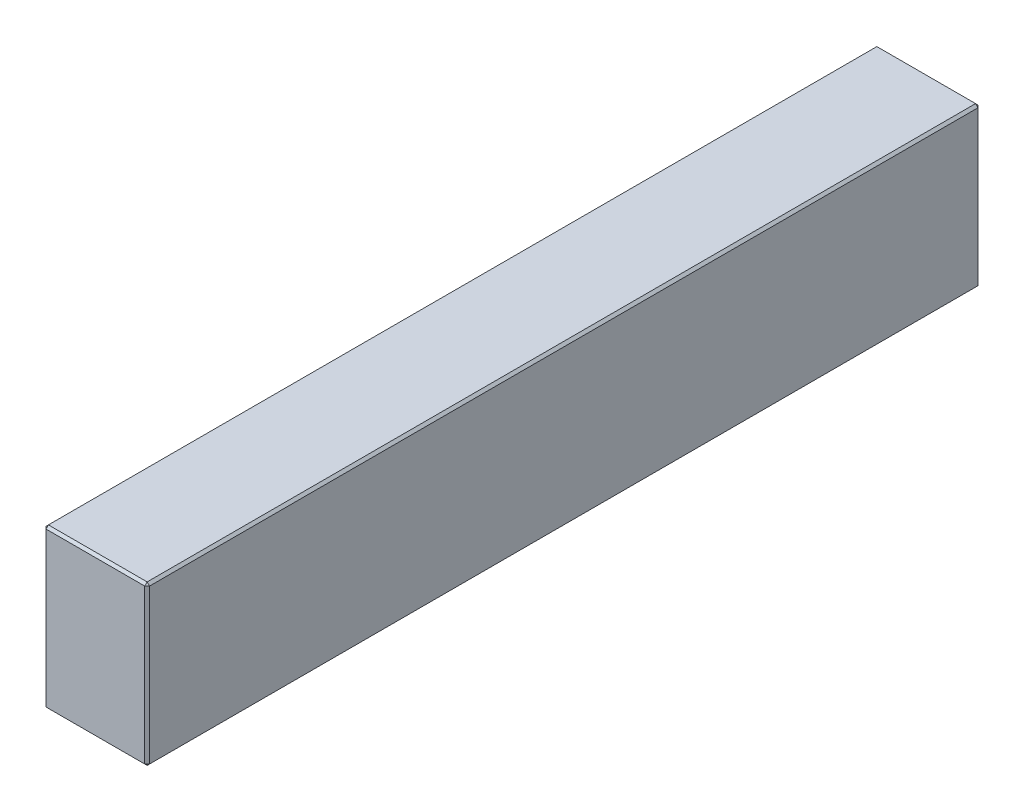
ISO-10303-21;
HEADER;
FILE_DESCRIPTION(('STEP AP214'),'2;1');
FILE_NAME('part.step','',(''),(''),'','','');
FILE_SCHEMA(('AUTOMOTIVE_DESIGN { 1 0 10303 214 1 1 1 1 }'));
ENDSEC;
DATA;
#1=APPLICATION_CONTEXT('core data for automotive mechanical design processes');
#2=APPLICATION_PROTOCOL_DEFINITION('international standard','automotive_design',2000,#1);
#3=PRODUCT_CONTEXT('',#1,'mechanical');
#4=PRODUCT('Part','Part','',(#3));
#5=PRODUCT_RELATED_PRODUCT_CATEGORY('part','',(#4));
#6=PRODUCT_DEFINITION_FORMATION('','',#4);
#7=PRODUCT_DEFINITION_CONTEXT('part definition',#1,'design');
#8=PRODUCT_DEFINITION('design','',#6,#7);
#9=PRODUCT_DEFINITION_SHAPE('','',#8);
#10=(LENGTH_UNIT() NAMED_UNIT(*) SI_UNIT(.MILLI.,.METRE.));
#11=(NAMED_UNIT(*) PLANE_ANGLE_UNIT() SI_UNIT($,.RADIAN.));
#12=(NAMED_UNIT(*) SI_UNIT($,.STERADIAN.) SOLID_ANGLE_UNIT());
#13=UNCERTAINTY_MEASURE_WITH_UNIT(LENGTH_MEASURE(1.E-05),#10,'distance_accuracy_value','');
#14=(GEOMETRIC_REPRESENTATION_CONTEXT(3) GLOBAL_UNCERTAINTY_ASSIGNED_CONTEXT((#13)) GLOBAL_UNIT_ASSIGNED_CONTEXT((#10,
#11,#12)) REPRESENTATION_CONTEXT('',''));
#15=CARTESIAN_POINT('',(0.,0.,0.));
#16=DIRECTION('',(0.,0.,1.));
#17=DIRECTION('',(1.,0.,0.));
#18=AXIS2_PLACEMENT_3D('',#15,#16,#17);
#19=CARTESIAN_POINT('',(-21.5,66.,173.));
#20=DIRECTION('',(1.,0.,0.));
#21=DIRECTION('',(0.,0.,-1.));
#22=AXIS2_PLACEMENT_3D('',#19,#20,#21);
#23=PLANE('',#22);
#24=DIRECTION('',(0.,-1.,0.));
#25=VECTOR('',#24,1.);
#26=CARTESIAN_POINT('',(-21.5,66.,-172.));
#27=LINE('',#26,#25);
#28=CARTESIAN_POINT('',(-21.5,65.,-172.));
#29=VERTEX_POINT('',#28);
#30=CARTESIAN_POINT('',(-21.5,1.,-172.));
#31=VERTEX_POINT('',#30);
#32=EDGE_CURVE('E114',#29,#31,#27,.T.);
#33=ORIENTED_EDGE('',*,*,#32,.T.);
#34=DIRECTION('',(0.,0.,1.));
#35=VECTOR('',#34,1.);
#36=CARTESIAN_POINT('',(-21.5,1.,173.));
#37=LINE('',#36,#35);
#38=CARTESIAN_POINT('',(-21.5,1.,172.));
#39=VERTEX_POINT('',#38);
#40=EDGE_CURVE('E110',#31,#39,#37,.T.);
#41=ORIENTED_EDGE('',*,*,#40,.T.);
#42=DIRECTION('',(0.,1.,0.));
#43=VECTOR('',#42,1.);
#44=CARTESIAN_POINT('',(-21.5,66.,172.));
#45=LINE('',#44,#43);
#46=CARTESIAN_POINT('',(-21.5,65.,172.));
#47=VERTEX_POINT('',#46);
#48=EDGE_CURVE('E103',#39,#47,#45,.T.);
#49=ORIENTED_EDGE('',*,*,#48,.T.);
#50=DIRECTION('',(0.,0.,-1.));
#51=VECTOR('',#50,1.);
#52=CARTESIAN_POINT('',(-21.5,65.,-173.));
#53=LINE('',#52,#51);
#54=EDGE_CURVE('E107',#47,#29,#53,.T.);
#55=ORIENTED_EDGE('',*,*,#54,.T.);
#56=EDGE_LOOP('',(#33,#41,#49,#55));
#57=FACE_BOUND('',#56,.T.);
#58=ADVANCED_FACE('F15',(#57),#23,.F.);
#59=CARTESIAN_POINT('',(21.5,66.,173.));
#60=DIRECTION('',(0.,0.,-1.));
#61=DIRECTION('',(-1.,0.,0.));
#62=AXIS2_PLACEMENT_3D('',#59,#60,#61);
#63=PLANE('',#62);
#64=DIRECTION('',(-1.,0.,0.));
#65=VECTOR('',#64,1.);
#66=CARTESIAN_POINT('',(-21.5,65.,173.));
#67=LINE('',#66,#65);
#68=CARTESIAN_POINT('',(20.5,65.,173.));
#69=VERTEX_POINT('',#68);
#70=CARTESIAN_POINT('',(-20.5,65.,173.));
#71=VERTEX_POINT('',#70);
#72=EDGE_CURVE('E164',#69,#71,#67,.T.);
#73=ORIENTED_EDGE('',*,*,#72,.T.);
#74=DIRECTION('',(0.,-1.,0.));
#75=VECTOR('',#74,1.);
#76=CARTESIAN_POINT('',(-20.5,66.,173.));
#77=LINE('',#76,#75);
#78=CARTESIAN_POINT('',(-20.5,1.,173.));
#79=VERTEX_POINT('',#78);
#80=EDGE_CURVE('E122',#71,#79,#77,.T.);
#81=ORIENTED_EDGE('',*,*,#80,.T.);
#82=DIRECTION('',(1.,0.,0.));
#83=VECTOR('',#82,1.);
#84=CARTESIAN_POINT('',(21.5,1.,173.));
#85=LINE('',#84,#83);
#86=CARTESIAN_POINT('',(20.5,1.,173.));
#87=VERTEX_POINT('',#86);
#88=EDGE_CURVE('E168',#79,#87,#85,.T.);
#89=ORIENTED_EDGE('',*,*,#88,.T.);
#90=DIRECTION('',(0.,1.,0.));
#91=VECTOR('',#90,1.);
#92=CARTESIAN_POINT('',(20.5,66.,173.));
#93=LINE('',#92,#91);
#94=EDGE_CURVE('E166',#87,#69,#93,.T.);
#95=ORIENTED_EDGE('',*,*,#94,.T.);
#96=EDGE_LOOP('',(#73,#81,#89,#95));
#97=FACE_BOUND('',#96,.T.);
#98=ADVANCED_FACE('F275',(#97),#63,.F.);
#99=CARTESIAN_POINT('',(21.5,66.,173.));
#100=DIRECTION('',(-1.,0.,0.));
#101=DIRECTION('',(0.,0.,1.));
#102=AXIS2_PLACEMENT_3D('',#99,#100,#101);
#103=PLANE('',#102);
#104=DIRECTION('',(0.,0.,-1.));
#105=VECTOR('',#104,1.);
#106=CARTESIAN_POINT('',(21.5,1.,173.));
#107=LINE('',#106,#105);
#108=CARTESIAN_POINT('',(21.5,1.,172.));
#109=VERTEX_POINT('',#108);
#110=CARTESIAN_POINT('',(21.5,1.,-172.));
#111=VERTEX_POINT('',#110);
#112=EDGE_CURVE('E159',#109,#111,#107,.T.);
#113=ORIENTED_EDGE('',*,*,#112,.T.);
#114=DIRECTION('',(0.,1.,0.));
#115=VECTOR('',#114,1.);
#116=CARTESIAN_POINT('',(21.5,66.,-172.));
#117=LINE('',#116,#115);
#118=CARTESIAN_POINT('',(21.5,65.,-172.));
#119=VERTEX_POINT('',#118);
#120=EDGE_CURVE('E161',#111,#119,#117,.T.);
#121=ORIENTED_EDGE('',*,*,#120,.T.);
#122=DIRECTION('',(0.,0.,1.));
#123=VECTOR('',#122,1.);
#124=CARTESIAN_POINT('',(21.5,65.,173.));
#125=LINE('',#124,#123);
#126=CARTESIAN_POINT('',(21.5,65.,172.));
#127=VERTEX_POINT('',#126);
#128=EDGE_CURVE('E155',#119,#127,#125,.T.);
#129=ORIENTED_EDGE('',*,*,#128,.T.);
#130=DIRECTION('',(0.,-1.,0.));
#131=VECTOR('',#130,1.);
#132=CARTESIAN_POINT('',(21.5,66.,172.));
#133=LINE('',#132,#131);
#134=EDGE_CURVE('E157',#127,#109,#133,.T.);
#135=ORIENTED_EDGE('',*,*,#134,.T.);
#136=EDGE_LOOP('',(#113,#121,#129,#135));
#137=FACE_BOUND('',#136,.T.);
#138=ADVANCED_FACE('F254',(#137),#103,.F.);
#139=CARTESIAN_POINT('',(21.5,66.,-173.));
#140=DIRECTION('',(0.,0.,1.));
#141=DIRECTION('',(1.,0.,0.));
#142=AXIS2_PLACEMENT_3D('',#139,#140,#141);
#143=PLANE('',#142);
#144=DIRECTION('',(0.,-1.,0.));
#145=VECTOR('',#144,1.);
#146=CARTESIAN_POINT('',(20.5,66.,-173.));
#147=LINE('',#146,#145);
#148=CARTESIAN_POINT('',(20.5,65.,-173.));
#149=VERTEX_POINT('',#148);
#150=CARTESIAN_POINT('',(20.5,1.,-173.));
#151=VERTEX_POINT('',#150);
#152=EDGE_CURVE('E148',#149,#151,#147,.T.);
#153=ORIENTED_EDGE('',*,*,#152,.T.);
#154=DIRECTION('',(-1.,0.,0.));
#155=VECTOR('',#154,1.);
#156=CARTESIAN_POINT('',(21.5,1.,-173.));
#157=LINE('',#156,#155);
#158=CARTESIAN_POINT('',(-20.5,1.,-173.));
#159=VERTEX_POINT('',#158);
#160=EDGE_CURVE('E153',#151,#159,#157,.T.);
#161=ORIENTED_EDGE('',*,*,#160,.T.);
#162=DIRECTION('',(0.,1.,0.));
#163=VECTOR('',#162,1.);
#164=CARTESIAN_POINT('',(-20.5,66.,-173.));
#165=LINE('',#164,#163);
#166=CARTESIAN_POINT('',(-20.5,65.,-173.));
#167=VERTEX_POINT('',#166);
#168=EDGE_CURVE('E150',#159,#167,#165,.T.);
#169=ORIENTED_EDGE('',*,*,#168,.T.);
#170=DIRECTION('',(1.,0.,0.));
#171=VECTOR('',#170,1.);
#172=CARTESIAN_POINT('',(21.5,65.,-173.));
#173=LINE('',#172,#171);
#174=EDGE_CURVE('E146',#167,#149,#173,.T.);
#175=ORIENTED_EDGE('',*,*,#174,.T.);
#176=EDGE_LOOP('',(#153,#161,#169,#175));
#177=FACE_BOUND('',#176,.T.);
#178=ADVANCED_FACE('F284',(#177),#143,.F.);
#179=CARTESIAN_POINT('',(0.,66.,0.));
#180=DIRECTION('',(0.,1.,0.));
#181=DIRECTION('',(0.,0.,1.));
#182=AXIS2_PLACEMENT_3D('',#179,#180,#181);
#183=PLANE('',#182);
#184=DIRECTION('',(0.,0.,-1.));
#185=VECTOR('',#184,1.);
#186=CARTESIAN_POINT('',(20.5,66.,-173.));
#187=LINE('',#186,#185);
#188=CARTESIAN_POINT('',(20.5,66.,172.));
#189=VERTEX_POINT('',#188);
#190=CARTESIAN_POINT('',(20.5,66.,-172.));
#191=VERTEX_POINT('',#190);
#192=EDGE_CURVE('E24',#189,#191,#187,.T.);
#193=ORIENTED_EDGE('',*,*,#192,.T.);
#194=DIRECTION('',(-1.,0.,0.));
#195=VECTOR('',#194,1.);
#196=CARTESIAN_POINT('',(-21.5,66.,-172.));
#197=LINE('',#196,#195);
#198=CARTESIAN_POINT('',(-20.5,66.,-172.));
#199=VERTEX_POINT('',#198);
#200=EDGE_CURVE('E9',#191,#199,#197,.T.);
#201=ORIENTED_EDGE('',*,*,#200,.T.);
#202=DIRECTION('',(0.,0.,1.));
#203=VECTOR('',#202,1.);
#204=CARTESIAN_POINT('',(-20.5,66.,173.));
#205=LINE('',#204,#203);
#206=CARTESIAN_POINT('',(-20.5,66.,172.));
#207=VERTEX_POINT('',#206);
#208=EDGE_CURVE('E180',#199,#207,#205,.T.);
#209=ORIENTED_EDGE('',*,*,#208,.T.);
#210=DIRECTION('',(1.,0.,0.));
#211=VECTOR('',#210,1.);
#212=CARTESIAN_POINT('',(21.5,66.,172.));
#213=LINE('',#212,#211);
#214=EDGE_CURVE('E35',#207,#189,#213,.T.);
#215=ORIENTED_EDGE('',*,*,#214,.T.);
#216=EDGE_LOOP('',(#193,#201,#209,#215));
#217=FACE_BOUND('',#216,.T.);
#218=ADVANCED_FACE('F350',(#217),#183,.T.);
#219=CARTESIAN_POINT('',(0.,0.,0.));
#220=DIRECTION('',(0.,1.,0.));
#221=DIRECTION('',(0.,0.,1.));
#222=AXIS2_PLACEMENT_3D('',#219,#220,#221);
#223=PLANE('',#222);
#224=DIRECTION('',(0.,0.,1.));
#225=VECTOR('',#224,1.);
#226=CARTESIAN_POINT('',(20.5,0.,0.));
#227=LINE('',#226,#225);
#228=CARTESIAN_POINT('',(20.5,0.,-172.));
#229=VERTEX_POINT('',#228);
#230=CARTESIAN_POINT('',(20.5,0.,172.));
#231=VERTEX_POINT('',#230);
#232=EDGE_CURVE('E171',#229,#231,#227,.T.);
#233=ORIENTED_EDGE('',*,*,#232,.T.);
#234=DIRECTION('',(-1.,0.,0.));
#235=VECTOR('',#234,1.);
#236=CARTESIAN_POINT('',(0.,0.,172.));
#237=LINE('',#236,#235);
#238=CARTESIAN_POINT('',(-20.5,0.,172.));
#239=VERTEX_POINT('',#238);
#240=EDGE_CURVE('E177',#231,#239,#237,.T.);
#241=ORIENTED_EDGE('',*,*,#240,.T.);
#242=DIRECTION('',(0.,0.,-1.));
#243=VECTOR('',#242,1.);
#244=CARTESIAN_POINT('',(-20.5,0.,0.));
#245=LINE('',#244,#243);
#246=CARTESIAN_POINT('',(-20.5,0.,-172.));
#247=VERTEX_POINT('',#246);
#248=EDGE_CURVE('E175',#239,#247,#245,.T.);
#249=ORIENTED_EDGE('',*,*,#248,.T.);
#250=DIRECTION('',(1.,0.,0.));
#251=VECTOR('',#250,1.);
#252=CARTESIAN_POINT('',(0.,0.,-172.));
#253=LINE('',#252,#251);
#254=EDGE_CURVE('E173',#247,#229,#253,.T.);
#255=ORIENTED_EDGE('',*,*,#254,.T.);
#256=EDGE_LOOP('',(#233,#241,#249,#255));
#257=FACE_BOUND('',#256,.T.);
#258=ADVANCED_FACE('F246',(#257),#223,.F.);
#259=CARTESIAN_POINT('',(21.5,66.,172.));
#260=DIRECTION('',(-0.707106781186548,0.,-0.707106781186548));
#261=DIRECTION('',(0.,-1.,0.));
#262=AXIS2_PLACEMENT_3D('',#259,#260,#261);
#263=PLANE('',#262);
#264=DIRECTION('',(-0.707106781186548,0.,0.707106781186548));
#265=VECTOR('',#264,1.);
#266=CARTESIAN_POINT('',(20.5,65.,173.));
#267=LINE('',#266,#265);
#268=EDGE_CURVE('E19',#69,#127,#267,.F.);
#269=ORIENTED_EDGE('',*,*,#268,.F.);
#270=ORIENTED_EDGE('',*,*,#94,.F.);
#271=DIRECTION('',(0.707106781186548,0.,-0.707106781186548));
#272=VECTOR('',#271,1.);
#273=CARTESIAN_POINT('',(20.5,1.,173.));
#274=LINE('',#273,#272);
#275=EDGE_CURVE('E142',#109,#87,#274,.F.);
#276=ORIENTED_EDGE('',*,*,#275,.F.);
#277=ORIENTED_EDGE('',*,*,#134,.F.);
#278=EDGE_LOOP('',(#269,#270,#276,#277));
#279=FACE_BOUND('',#278,.T.);
#280=ADVANCED_FACE('F17',(#279),#263,.F.);
#281=CARTESIAN_POINT('',(20.5,65.,173.));
#282=DIRECTION('',(0.577350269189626,0.577350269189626,0.577350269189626));
#283=DIRECTION('',(0.707106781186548,0.,-0.707106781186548));
#284=AXIS2_PLACEMENT_3D('',#281,#282,#283);
#285=PLANE('',#284);
#286=DIRECTION('',(0.,-0.707106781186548,0.707106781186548));
#287=VECTOR('',#286,1.);
#288=CARTESIAN_POINT('',(20.5,65.,173.));
#289=LINE('',#288,#287);
#290=EDGE_CURVE('E226',#69,#189,#289,.F.);
#291=ORIENTED_EDGE('',*,*,#290,.F.);
#292=ORIENTED_EDGE('',*,*,#268,.T.);
#293=DIRECTION('',(-0.707106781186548,0.707106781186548,0.));
#294=VECTOR('',#293,1.);
#295=CARTESIAN_POINT('',(21.,65.5,172.));
#296=LINE('',#295,#294);
#297=EDGE_CURVE('E228',#189,#127,#296,.F.);
#298=ORIENTED_EDGE('',*,*,#297,.F.);
#299=EDGE_LOOP('',(#291,#292,#298));
#300=FACE_BOUND('',#299,.T.);
#301=ADVANCED_FACE('F270',(#300),#285,.T.);
#302=CARTESIAN_POINT('',(20.5,1.,173.));
#303=DIRECTION('',(0.577350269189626,-0.577350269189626,0.577350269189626));
#304=DIRECTION('',(0.707106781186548,0.,-0.707106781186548));
#305=AXIS2_PLACEMENT_3D('',#302,#303,#304);
#306=PLANE('',#305);
#307=DIRECTION('',(-0.707106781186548,-0.707106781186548,0.));
#308=VECTOR('',#307,1.);
#309=CARTESIAN_POINT('',(21.,0.5,172.));
#310=LINE('',#309,#308);
#311=EDGE_CURVE('E220',#109,#231,#310,.T.);
#312=ORIENTED_EDGE('',*,*,#311,.F.);
#313=ORIENTED_EDGE('',*,*,#275,.T.);
#314=DIRECTION('',(0.,0.707106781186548,0.707106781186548));
#315=VECTOR('',#314,1.);
#316=CARTESIAN_POINT('',(20.5,1.,173.));
#317=LINE('',#316,#315);
#318=EDGE_CURVE('E223',#231,#87,#317,.T.);
#319=ORIENTED_EDGE('',*,*,#318,.F.);
#320=EDGE_LOOP('',(#312,#313,#319));
#321=FACE_BOUND('',#320,.T.);
#322=ADVANCED_FACE('F235',(#321),#306,.T.);
#323=CARTESIAN_POINT('',(20.5,66.,0.));
#324=DIRECTION('',(0.707106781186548,0.707106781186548,0.));
#325=DIRECTION('',(0.,0.,1.));
#326=AXIS2_PLACEMENT_3D('',#323,#324,#325);
#327=PLANE('',#326);
#328=ORIENTED_EDGE('',*,*,#297,.T.);
#329=ORIENTED_EDGE('',*,*,#128,.F.);
#330=DIRECTION('',(0.707106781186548,-0.707106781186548,0.));
#331=VECTOR('',#330,1.);
#332=CARTESIAN_POINT('',(21.5,65.,-172.));
#333=LINE('',#332,#331);
#334=EDGE_CURVE('E215',#191,#119,#333,.T.);
#335=ORIENTED_EDGE('',*,*,#334,.F.);
#336=ORIENTED_EDGE('',*,*,#192,.F.);
#337=EDGE_LOOP('',(#328,#329,#335,#336));
#338=FACE_BOUND('',#337,.T.);
#339=ADVANCED_FACE('F265',(#338),#327,.T.);
#340=CARTESIAN_POINT('',(0.,66.,172.));
#341=DIRECTION('',(0.,0.707106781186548,0.707106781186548));
#342=DIRECTION('',(-1.,0.,0.));
#343=AXIS2_PLACEMENT_3D('',#340,#341,#342);
#344=PLANE('',#343);
#345=ORIENTED_EDGE('',*,*,#290,.T.);
#346=ORIENTED_EDGE('',*,*,#214,.F.);
#347=DIRECTION('',(0.,0.707106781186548,-0.707106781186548));
#348=VECTOR('',#347,1.);
#349=CARTESIAN_POINT('',(-20.5,65.5,172.5));
#350=LINE('',#349,#348);
#351=EDGE_CURVE('E126',#71,#207,#350,.T.);
#352=ORIENTED_EDGE('',*,*,#351,.F.);
#353=ORIENTED_EDGE('',*,*,#72,.F.);
#354=EDGE_LOOP('',(#345,#346,#352,#353));
#355=FACE_BOUND('',#354,.T.);
#356=ADVANCED_FACE('F273',(#355),#344,.T.);
#357=CARTESIAN_POINT('',(-20.5,66.,173.));
#358=DIRECTION('',(0.707106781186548,0.,-0.707106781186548));
#359=DIRECTION('',(0.,-1.,0.));
#360=AXIS2_PLACEMENT_3D('',#357,#358,#359);
#361=PLANE('',#360);
#362=DIRECTION('',(0.707106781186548,0.,0.707106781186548));
#363=VECTOR('',#362,1.);
#364=CARTESIAN_POINT('',(-20.5,1.,173.));
#365=LINE('',#364,#363);
#366=EDGE_CURVE('E127',#79,#39,#365,.F.);
#367=ORIENTED_EDGE('',*,*,#366,.F.);
#368=ORIENTED_EDGE('',*,*,#80,.F.);
#369=DIRECTION('',(-0.707106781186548,0.,-0.707106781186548));
#370=VECTOR('',#369,1.);
#371=CARTESIAN_POINT('',(-21.5,65.,172.));
#372=LINE('',#371,#370);
#373=EDGE_CURVE('E118',#47,#71,#372,.F.);
#374=ORIENTED_EDGE('',*,*,#373,.F.);
#375=ORIENTED_EDGE('',*,*,#48,.F.);
#376=EDGE_LOOP('',(#367,#368,#374,#375));
#377=FACE_BOUND('',#376,.T.);
#378=ADVANCED_FACE('F120',(#377),#361,.F.);
#379=CARTESIAN_POINT('',(21.5,1.,173.));
#380=DIRECTION('',(0.,0.707106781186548,-0.707106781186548));
#381=DIRECTION('',(1.,0.,0.));
#382=AXIS2_PLACEMENT_3D('',#379,#380,#381);
#383=PLANE('',#382);
#384=ORIENTED_EDGE('',*,*,#318,.T.);
#385=ORIENTED_EDGE('',*,*,#88,.F.);
#386=DIRECTION('',(0.,-0.707106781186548,-0.707106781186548));
#387=VECTOR('',#386,1.);
#388=CARTESIAN_POINT('',(-20.5,1.,173.));
#389=LINE('',#388,#387);
#390=EDGE_CURVE('E211',#239,#79,#389,.F.);
#391=ORIENTED_EDGE('',*,*,#390,.F.);
#392=ORIENTED_EDGE('',*,*,#240,.F.);
#393=EDGE_LOOP('',(#384,#385,#391,#392));
#394=FACE_BOUND('',#393,.T.);
#395=ADVANCED_FACE('F243',(#394),#383,.F.);
#396=CARTESIAN_POINT('',(21.5,1.,173.));
#397=DIRECTION('',(-0.707106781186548,0.707106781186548,0.));
#398=DIRECTION('',(0.,0.,-1.));
#399=AXIS2_PLACEMENT_3D('',#396,#397,#398);
#400=PLANE('',#399);
#401=ORIENTED_EDGE('',*,*,#311,.T.);
#402=ORIENTED_EDGE('',*,*,#232,.F.);
#403=DIRECTION('',(0.707106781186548,0.707106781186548,0.));
#404=VECTOR('',#403,1.);
#405=CARTESIAN_POINT('',(21.,0.5,-172.));
#406=LINE('',#405,#404);
#407=EDGE_CURVE('E208',#111,#229,#406,.F.);
#408=ORIENTED_EDGE('',*,*,#407,.F.);
#409=ORIENTED_EDGE('',*,*,#112,.F.);
#410=EDGE_LOOP('',(#401,#402,#408,#409));
#411=FACE_BOUND('',#410,.T.);
#412=ADVANCED_FACE('F251',(#411),#400,.F.);
#413=CARTESIAN_POINT('',(20.5,66.,-173.));
#414=DIRECTION('',(-0.707106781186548,0.,0.707106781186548));
#415=DIRECTION('',(0.,-1.,0.));
#416=AXIS2_PLACEMENT_3D('',#413,#414,#415);
#417=PLANE('',#416);
#418=DIRECTION('',(0.707106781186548,0.,0.707106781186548));
#419=VECTOR('',#418,1.);
#420=CARTESIAN_POINT('',(21.5,65.,-172.));
#421=LINE('',#420,#419);
#422=EDGE_CURVE('E217',#119,#149,#421,.F.);
#423=ORIENTED_EDGE('',*,*,#422,.F.);
#424=ORIENTED_EDGE('',*,*,#120,.F.);
#425=DIRECTION('',(-0.707106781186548,0.,-0.707106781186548));
#426=VECTOR('',#425,1.);
#427=CARTESIAN_POINT('',(20.5,1.,-173.));
#428=LINE('',#427,#426);
#429=EDGE_CURVE('E205',#151,#111,#428,.F.);
#430=ORIENTED_EDGE('',*,*,#429,.F.);
#431=ORIENTED_EDGE('',*,*,#152,.F.);
#432=EDGE_LOOP('',(#423,#424,#430,#431));
#433=FACE_BOUND('',#432,.T.);
#434=ADVANCED_FACE('F258',(#433),#417,.F.);
#435=CARTESIAN_POINT('',(21.5,65.,-172.));
#436=DIRECTION('',(0.577350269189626,0.577350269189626,-0.577350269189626));
#437=DIRECTION('',(-0.707106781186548,0.,-0.707106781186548));
#438=AXIS2_PLACEMENT_3D('',#435,#436,#437);
#439=PLANE('',#438);
#440=ORIENTED_EDGE('',*,*,#334,.T.);
#441=ORIENTED_EDGE('',*,*,#422,.T.);
#442=DIRECTION('',(0.,0.707106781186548,0.707106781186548));
#443=VECTOR('',#442,1.);
#444=CARTESIAN_POINT('',(20.5,65.5,-172.5));
#445=LINE('',#444,#443);
#446=EDGE_CURVE('E134',#191,#149,#445,.F.);
#447=ORIENTED_EDGE('',*,*,#446,.F.);
#448=EDGE_LOOP('',(#440,#441,#447));
#449=FACE_BOUND('',#448,.T.);
#450=ADVANCED_FACE('F325',(#449),#439,.T.);
#451=CARTESIAN_POINT('',(-21.5,65.,172.));
#452=DIRECTION('',(-0.577350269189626,0.577350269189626,0.577350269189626));
#453=DIRECTION('',(0.707106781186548,0.,0.707106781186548));
#454=AXIS2_PLACEMENT_3D('',#451,#452,#453);
#455=PLANE('',#454);
#456=ORIENTED_EDGE('',*,*,#373,.T.);
#457=ORIENTED_EDGE('',*,*,#351,.T.);
#458=DIRECTION('',(-0.707106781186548,-0.707106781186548,0.));
#459=VECTOR('',#458,1.);
#460=CARTESIAN_POINT('',(-21.5,65.,172.));
#461=LINE('',#460,#459);
#462=EDGE_CURVE('E130',#47,#207,#461,.F.);
#463=ORIENTED_EDGE('',*,*,#462,.F.);
#464=EDGE_LOOP('',(#456,#457,#463));
#465=FACE_BOUND('',#464,.T.);
#466=ADVANCED_FACE('F131',(#465),#455,.T.);
#467=CARTESIAN_POINT('',(-20.5,1.,173.));
#468=DIRECTION('',(-0.577350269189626,-0.577350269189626,0.577350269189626));
#469=DIRECTION('',(0.707106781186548,0.,0.707106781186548));
#470=AXIS2_PLACEMENT_3D('',#467,#468,#469);
#471=PLANE('',#470);
#472=ORIENTED_EDGE('',*,*,#390,.T.);
#473=ORIENTED_EDGE('',*,*,#366,.T.);
#474=DIRECTION('',(-0.707106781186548,0.707106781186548,0.));
#475=VECTOR('',#474,1.);
#476=CARTESIAN_POINT('',(-21.,0.5,172.));
#477=LINE('',#476,#475);
#478=EDGE_CURVE('E135',#239,#39,#477,.T.);
#479=ORIENTED_EDGE('',*,*,#478,.F.);
#480=EDGE_LOOP('',(#472,#473,#479));
#481=FACE_BOUND('',#480,.T.);
#482=ADVANCED_FACE('F318',(#481),#471,.T.);
#483=CARTESIAN_POINT('',(20.5,1.,-173.));
#484=DIRECTION('',(0.577350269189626,-0.577350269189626,-0.577350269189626));
#485=DIRECTION('',(-0.707106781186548,0.,-0.707106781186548));
#486=AXIS2_PLACEMENT_3D('',#483,#484,#485);
#487=PLANE('',#486);
#488=ORIENTED_EDGE('',*,*,#429,.T.);
#489=ORIENTED_EDGE('',*,*,#407,.T.);
#490=DIRECTION('',(0.,-0.707106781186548,0.707106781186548));
#491=VECTOR('',#490,1.);
#492=CARTESIAN_POINT('',(20.5,1.,-173.));
#493=LINE('',#492,#491);
#494=EDGE_CURVE('E198',#151,#229,#493,.T.);
#495=ORIENTED_EDGE('',*,*,#494,.F.);
#496=EDGE_LOOP('',(#488,#489,#495));
#497=FACE_BOUND('',#496,.T.);
#498=ADVANCED_FACE('F314',(#497),#487,.T.);
#499=CARTESIAN_POINT('',(0.,66.,-172.));
#500=DIRECTION('',(0.,0.707106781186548,-0.707106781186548));
#501=DIRECTION('',(1.,0.,0.));
#502=AXIS2_PLACEMENT_3D('',#499,#500,#501);
#503=PLANE('',#502);
#504=ORIENTED_EDGE('',*,*,#446,.T.);
#505=ORIENTED_EDGE('',*,*,#174,.F.);
#506=DIRECTION('',(0.,-0.707106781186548,-0.707106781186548));
#507=VECTOR('',#506,1.);
#508=CARTESIAN_POINT('',(-20.5,65.,-173.));
#509=LINE('',#508,#507);
#510=EDGE_CURVE('E195',#199,#167,#509,.T.);
#511=ORIENTED_EDGE('',*,*,#510,.F.);
#512=ORIENTED_EDGE('',*,*,#200,.F.);
#513=EDGE_LOOP('',(#504,#505,#511,#512));
#514=FACE_BOUND('',#513,.T.);
#515=ADVANCED_FACE('F311',(#514),#503,.T.);
#516=CARTESIAN_POINT('',(-20.5,66.,0.));
#517=DIRECTION('',(-0.707106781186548,0.707106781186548,0.));
#518=DIRECTION('',(0.,0.,-1.));
#519=AXIS2_PLACEMENT_3D('',#516,#517,#518);
#520=PLANE('',#519);
#521=ORIENTED_EDGE('',*,*,#462,.T.);
#522=ORIENTED_EDGE('',*,*,#208,.F.);
#523=DIRECTION('',(0.707106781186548,0.707106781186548,0.));
#524=VECTOR('',#523,1.);
#525=CARTESIAN_POINT('',(-21.,65.5,-172.));
#526=LINE('',#525,#524);
#527=EDGE_CURVE('E138',#29,#199,#526,.T.);
#528=ORIENTED_EDGE('',*,*,#527,.F.);
#529=ORIENTED_EDGE('',*,*,#54,.F.);
#530=EDGE_LOOP('',(#521,#522,#528,#529));
#531=FACE_BOUND('',#530,.T.);
#532=ADVANCED_FACE('F137',(#531),#520,.T.);
#533=CARTESIAN_POINT('',(-21.5,1.,173.));
#534=DIRECTION('',(0.707106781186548,0.707106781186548,0.));
#535=DIRECTION('',(0.,0.,1.));
#536=AXIS2_PLACEMENT_3D('',#533,#534,#535);
#537=PLANE('',#536);
#538=ORIENTED_EDGE('',*,*,#478,.T.);
#539=ORIENTED_EDGE('',*,*,#40,.F.);
#540=DIRECTION('',(0.707106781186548,-0.707106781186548,0.));
#541=VECTOR('',#540,1.);
#542=CARTESIAN_POINT('',(-21.5,1.,-172.));
#543=LINE('',#542,#541);
#544=EDGE_CURVE('E191',#247,#31,#543,.F.);
#545=ORIENTED_EDGE('',*,*,#544,.F.);
#546=ORIENTED_EDGE('',*,*,#248,.F.);
#547=EDGE_LOOP('',(#538,#539,#545,#546));
#548=FACE_BOUND('',#547,.T.);
#549=ADVANCED_FACE('F304',(#548),#537,.F.);
#550=CARTESIAN_POINT('',(21.5,1.,-173.));
#551=DIRECTION('',(0.,0.707106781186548,0.707106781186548));
#552=DIRECTION('',(-1.,0.,0.));
#553=AXIS2_PLACEMENT_3D('',#550,#551,#552);
#554=PLANE('',#553);
#555=ORIENTED_EDGE('',*,*,#494,.T.);
#556=ORIENTED_EDGE('',*,*,#254,.F.);
#557=DIRECTION('',(0.,0.707106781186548,-0.707106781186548));
#558=VECTOR('',#557,1.);
#559=CARTESIAN_POINT('',(-20.5,0.5,-172.5));
#560=LINE('',#559,#558);
#561=EDGE_CURVE('E188',#159,#247,#560,.F.);
#562=ORIENTED_EDGE('',*,*,#561,.F.);
#563=ORIENTED_EDGE('',*,*,#160,.F.);
#564=EDGE_LOOP('',(#555,#556,#562,#563));
#565=FACE_BOUND('',#564,.T.);
#566=ADVANCED_FACE('F300',(#565),#554,.F.);
#567=CARTESIAN_POINT('',(-20.5,65.,-173.));
#568=DIRECTION('',(-0.577350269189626,0.577350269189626,-0.577350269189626));
#569=DIRECTION('',(-0.707106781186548,0.,0.707106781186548));
#570=AXIS2_PLACEMENT_3D('',#567,#568,#569);
#571=PLANE('',#570);
#572=ORIENTED_EDGE('',*,*,#527,.T.);
#573=ORIENTED_EDGE('',*,*,#510,.T.);
#574=DIRECTION('',(0.707106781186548,0.,-0.707106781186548));
#575=VECTOR('',#574,1.);
#576=CARTESIAN_POINT('',(-20.5,65.,-173.));
#577=LINE('',#576,#575);
#578=EDGE_CURVE('E186',#29,#167,#577,.T.);
#579=ORIENTED_EDGE('',*,*,#578,.F.);
#580=EDGE_LOOP('',(#572,#573,#579));
#581=FACE_BOUND('',#580,.T.);
#582=ADVANCED_FACE('F296',(#581),#571,.T.);
#583=CARTESIAN_POINT('',(-21.5,1.,-172.));
#584=DIRECTION('',(-0.577350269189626,-0.577350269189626,-0.577350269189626));
#585=DIRECTION('',(-0.707106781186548,0.,0.707106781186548));
#586=AXIS2_PLACEMENT_3D('',#583,#584,#585);
#587=PLANE('',#586);
#588=ORIENTED_EDGE('',*,*,#561,.T.);
#589=ORIENTED_EDGE('',*,*,#544,.T.);
#590=DIRECTION('',(-0.707106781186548,0.,0.707106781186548));
#591=VECTOR('',#590,1.);
#592=CARTESIAN_POINT('',(-21.5,1.,-172.));
#593=LINE('',#592,#591);
#594=EDGE_CURVE('E184',#159,#31,#593,.T.);
#595=ORIENTED_EDGE('',*,*,#594,.F.);
#596=EDGE_LOOP('',(#588,#589,#595));
#597=FACE_BOUND('',#596,.T.);
#598=ADVANCED_FACE('F292',(#597),#587,.T.);
#599=CARTESIAN_POINT('',(-21.5,66.,-172.));
#600=DIRECTION('',(0.707106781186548,0.,0.707106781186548));
#601=DIRECTION('',(0.,-1.,0.));
#602=AXIS2_PLACEMENT_3D('',#599,#600,#601);
#603=PLANE('',#602);
#604=ORIENTED_EDGE('',*,*,#578,.T.);
#605=ORIENTED_EDGE('',*,*,#168,.F.);
#606=ORIENTED_EDGE('',*,*,#594,.T.);
#607=ORIENTED_EDGE('',*,*,#32,.F.);
#608=EDGE_LOOP('',(#604,#605,#606,#607));
#609=FACE_BOUND('',#608,.T.);
#610=ADVANCED_FACE('F289',(#609),#603,.F.);
#611=CLOSED_SHELL('',(#58,#98,#138,#178,#218,#258,#280,#301,#322,#339,#356,#378,#395,#412,#434,
#450,#466,#482,#498,#515,#532,#549,#566,#582,#598,#610));
#612=MANIFOLD_SOLID_BREP('B1',#611);
#613=ADVANCED_BREP_SHAPE_REPRESENTATION('',(#18,#612),#14);
#614=SHAPE_DEFINITION_REPRESENTATION(#9,#613);
ENDSEC;
END-ISO-10303-21;
